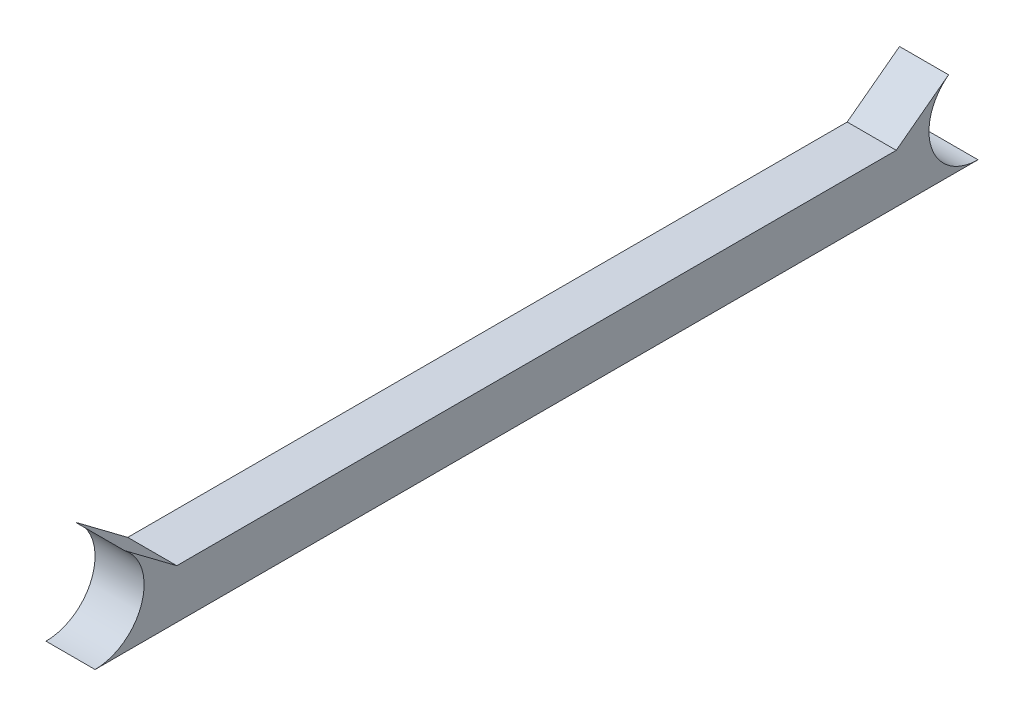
ISO-10303-21;
HEADER;
FILE_DESCRIPTION(('STEP AP214'),'2;1');
FILE_NAME('part.step','',(''),(''),'','','');
FILE_SCHEMA(('AUTOMOTIVE_DESIGN { 1 0 10303 214 1 1 1 1 }'));
ENDSEC;
DATA;
#1=APPLICATION_CONTEXT('core data for automotive mechanical design processes');
#2=APPLICATION_PROTOCOL_DEFINITION('international standard','automotive_design',2000,#1);
#3=PRODUCT_CONTEXT('',#1,'mechanical');
#4=PRODUCT('Part','Part','',(#3));
#5=PRODUCT_RELATED_PRODUCT_CATEGORY('part','',(#4));
#6=PRODUCT_DEFINITION_FORMATION('','',#4);
#7=PRODUCT_DEFINITION_CONTEXT('part definition',#1,'design');
#8=PRODUCT_DEFINITION('design','',#6,#7);
#9=PRODUCT_DEFINITION_SHAPE('','',#8);
#10=(LENGTH_UNIT() NAMED_UNIT(*) SI_UNIT(.MILLI.,.METRE.));
#11=(NAMED_UNIT(*) PLANE_ANGLE_UNIT() SI_UNIT($,.RADIAN.));
#12=(NAMED_UNIT(*) SI_UNIT($,.STERADIAN.) SOLID_ANGLE_UNIT());
#13=UNCERTAINTY_MEASURE_WITH_UNIT(LENGTH_MEASURE(1.E-05),#10,'distance_accuracy_value','');
#14=(GEOMETRIC_REPRESENTATION_CONTEXT(3) GLOBAL_UNCERTAINTY_ASSIGNED_CONTEXT((#13)) GLOBAL_UNIT_ASSIGNED_CONTEXT((#10,
#11,#12)) REPRESENTATION_CONTEXT('',''));
#15=CARTESIAN_POINT('',(0.,0.,0.));
#16=DIRECTION('',(0.,0.,1.));
#17=DIRECTION('',(1.,0.,0.));
#18=AXIS2_PLACEMENT_3D('',#15,#16,#17);
#19=CARTESIAN_POINT('',(22.5,0.,-810.));
#20=DIRECTION('',(-1.,0.,0.));
#21=DIRECTION('',(0.,0.,1.));
#22=AXIS2_PLACEMENT_3D('',#19,#20,#21);
#23=CYLINDRICAL_SURFACE('',#22,45.);
#24=CARTESIAN_POINT('',(-22.5,0.,-810.));
#25=DIRECTION('',(-1.,0.,0.));
#26=DIRECTION('',(0.,0.,1.));
#27=AXIS2_PLACEMENT_3D('',#24,#25,#26);
#28=CIRCLE('',#27,45.);
#29=CARTESIAN_POINT('',(-22.5,-45.,-810.));
#30=VERTEX_POINT('',#29);
#31=CARTESIAN_POINT('',(-22.5,36.,-783.));
#32=VERTEX_POINT('',#31);
#33=EDGE_CURVE('E116',#30,#32,#28,.T.);
#34=ORIENTED_EDGE('',*,*,#33,.T.);
#35=DIRECTION('',(-1.,0.,0.));
#36=VECTOR('',#35,1.);
#37=CARTESIAN_POINT('',(22.5,36.,-783.));
#38=LINE('',#37,#36);
#39=CARTESIAN_POINT('',(22.5,36.,-783.));
#40=VERTEX_POINT('',#39);
#41=EDGE_CURVE('E11',#40,#32,#38,.T.);
#42=ORIENTED_EDGE('',*,*,#41,.F.);
#43=CARTESIAN_POINT('',(22.5,0.,-810.));
#44=DIRECTION('',(-1.,0.,0.));
#45=DIRECTION('',(0.,0.,1.));
#46=AXIS2_PLACEMENT_3D('',#43,#44,#45);
#47=CIRCLE('',#46,45.);
#48=CARTESIAN_POINT('',(22.5,-45.,-810.));
#49=VERTEX_POINT('',#48);
#50=EDGE_CURVE('E126',#49,#40,#47,.T.);
#51=ORIENTED_EDGE('',*,*,#50,.F.);
#52=DIRECTION('',(-1.,0.,0.));
#53=VECTOR('',#52,1.);
#54=CARTESIAN_POINT('',(22.5,-45.,-810.));
#55=LINE('',#54,#53);
#56=EDGE_CURVE('E112',#49,#30,#55,.T.);
#57=ORIENTED_EDGE('',*,*,#56,.T.);
#58=EDGE_LOOP('',(#34,#42,#51,#57));
#59=FACE_BOUND('',#58,.T.);
#60=ADVANCED_FACE('F32',(#59),#23,.F.);
#61=CARTESIAN_POINT('',(22.5,36.,-783.));
#62=DIRECTION('',(0.,-0.8,-0.6));
#63=DIRECTION('',(0.,0.6,-0.8));
#64=AXIS2_PLACEMENT_3D('',#61,#62,#63);
#65=PLANE('',#64);
#66=DIRECTION('',(0.,-0.6,0.8));
#67=VECTOR('',#66,1.);
#68=CARTESIAN_POINT('',(-22.5,36.,-783.));
#69=LINE('',#68,#67);
#70=CARTESIAN_POINT('',(-22.5,0.,-735.));
#71=VERTEX_POINT('',#70);
#72=EDGE_CURVE('E119',#32,#71,#69,.T.);
#73=ORIENTED_EDGE('',*,*,#72,.T.);
#74=DIRECTION('',(-1.,0.,0.));
#75=VECTOR('',#74,1.);
#76=CARTESIAN_POINT('',(22.5,0.,-735.));
#77=LINE('',#76,#75);
#78=CARTESIAN_POINT('',(22.5,0.,-735.));
#79=VERTEX_POINT('',#78);
#80=EDGE_CURVE('E40',#79,#71,#77,.T.);
#81=ORIENTED_EDGE('',*,*,#80,.F.);
#82=DIRECTION('',(0.,-0.6,0.8));
#83=VECTOR('',#82,1.);
#84=CARTESIAN_POINT('',(22.5,36.,-783.));
#85=LINE('',#84,#83);
#86=EDGE_CURVE('E85',#40,#79,#85,.T.);
#87=ORIENTED_EDGE('',*,*,#86,.F.);
#88=ORIENTED_EDGE('',*,*,#41,.T.);
#89=EDGE_LOOP('',(#73,#81,#87,#88));
#90=FACE_BOUND('',#89,.T.);
#91=ADVANCED_FACE('F150',(#90),#65,.F.);
#92=CARTESIAN_POINT('',(22.5,0.,-75.));
#93=DIRECTION('',(0.,-1.,0.));
#94=DIRECTION('',(0.,0.,-1.));
#95=AXIS2_PLACEMENT_3D('',#92,#93,#94);
#96=PLANE('',#95);
#97=DIRECTION('',(0.,0.,1.));
#98=VECTOR('',#97,1.);
#99=CARTESIAN_POINT('',(-22.5,0.,-75.));
#100=LINE('',#99,#98);
#101=CARTESIAN_POINT('',(-22.5,0.,-75.));
#102=VERTEX_POINT('',#101);
#103=EDGE_CURVE('E121',#71,#102,#100,.T.);
#104=ORIENTED_EDGE('',*,*,#103,.T.);
#105=DIRECTION('',(-1.,0.,0.));
#106=VECTOR('',#105,1.);
#107=CARTESIAN_POINT('',(22.5,0.,-75.));
#108=LINE('',#107,#106);
#109=CARTESIAN_POINT('',(22.5,0.,-75.));
#110=VERTEX_POINT('',#109);
#111=EDGE_CURVE('E107',#110,#102,#108,.T.);
#112=ORIENTED_EDGE('',*,*,#111,.F.);
#113=DIRECTION('',(0.,0.,1.));
#114=VECTOR('',#113,1.);
#115=CARTESIAN_POINT('',(22.5,0.,-75.));
#116=LINE('',#115,#114);
#117=EDGE_CURVE('E98',#79,#110,#116,.T.);
#118=ORIENTED_EDGE('',*,*,#117,.F.);
#119=ORIENTED_EDGE('',*,*,#80,.T.);
#120=EDGE_LOOP('',(#104,#112,#118,#119));
#121=FACE_BOUND('',#120,.T.);
#122=ADVANCED_FACE('F132',(#121),#96,.F.);
#123=CARTESIAN_POINT('',(22.5,36.,-27.));
#124=DIRECTION('',(0.,-0.8,0.6));
#125=DIRECTION('',(0.,-0.6,-0.8));
#126=AXIS2_PLACEMENT_3D('',#123,#124,#125);
#127=PLANE('',#126);
#128=DIRECTION('',(0.,0.6,0.8));
#129=VECTOR('',#128,1.);
#130=CARTESIAN_POINT('',(-22.5,36.,-27.));
#131=LINE('',#130,#129);
#132=CARTESIAN_POINT('',(-22.5,36.,-27.));
#133=VERTEX_POINT('',#132);
#134=EDGE_CURVE('E106',#102,#133,#131,.T.);
#135=ORIENTED_EDGE('',*,*,#134,.T.);
#136=DIRECTION('',(-1.,0.,0.));
#137=VECTOR('',#136,1.);
#138=CARTESIAN_POINT('',(22.5,36.,-27.));
#139=LINE('',#138,#137);
#140=CARTESIAN_POINT('',(22.5,36.,-27.));
#141=VERTEX_POINT('',#140);
#142=EDGE_CURVE('E103',#141,#133,#139,.T.);
#143=ORIENTED_EDGE('',*,*,#142,.F.);
#144=DIRECTION('',(0.,0.6,0.8));
#145=VECTOR('',#144,1.);
#146=CARTESIAN_POINT('',(22.5,36.,-27.));
#147=LINE('',#146,#145);
#148=EDGE_CURVE('E92',#110,#141,#147,.T.);
#149=ORIENTED_EDGE('',*,*,#148,.F.);
#150=ORIENTED_EDGE('',*,*,#111,.T.);
#151=EDGE_LOOP('',(#135,#143,#149,#150));
#152=FACE_BOUND('',#151,.T.);
#153=ADVANCED_FACE('F104',(#152),#127,.F.);
#154=CARTESIAN_POINT('',(22.5,0.,0.));
#155=DIRECTION('',(-1.,0.,0.));
#156=DIRECTION('',(0.,0.,1.));
#157=AXIS2_PLACEMENT_3D('',#154,#155,#156);
#158=CYLINDRICAL_SURFACE('',#157,45.);
#159=CARTESIAN_POINT('',(-22.5,0.,0.));
#160=DIRECTION('',(-1.,0.,0.));
#161=DIRECTION('',(0.,0.,-1.));
#162=AXIS2_PLACEMENT_3D('',#159,#160,#161);
#163=CIRCLE('',#162,45.);
#164=CARTESIAN_POINT('',(-22.5,-45.,0.));
#165=VERTEX_POINT('',#164);
#166=EDGE_CURVE('E71',#133,#165,#163,.T.);
#167=ORIENTED_EDGE('',*,*,#166,.T.);
#168=DIRECTION('',(-1.,0.,0.));
#169=VECTOR('',#168,1.);
#170=CARTESIAN_POINT('',(22.5,-45.,0.));
#171=LINE('',#170,#169);
#172=CARTESIAN_POINT('',(22.5,-45.,0.));
#173=VERTEX_POINT('',#172);
#174=EDGE_CURVE('E108',#173,#165,#171,.T.);
#175=ORIENTED_EDGE('',*,*,#174,.F.);
#176=CARTESIAN_POINT('',(22.5,0.,0.));
#177=DIRECTION('',(-1.,0.,0.));
#178=DIRECTION('',(0.,0.,-1.));
#179=AXIS2_PLACEMENT_3D('',#176,#177,#178);
#180=CIRCLE('',#179,45.);
#181=EDGE_CURVE('E96',#141,#173,#180,.T.);
#182=ORIENTED_EDGE('',*,*,#181,.F.);
#183=ORIENTED_EDGE('',*,*,#142,.T.);
#184=EDGE_LOOP('',(#167,#175,#182,#183));
#185=FACE_BOUND('',#184,.T.);
#186=ADVANCED_FACE('F110',(#185),#158,.F.);
#187=CARTESIAN_POINT('',(22.5,-45.,0.));
#188=DIRECTION('',(0.,1.,0.));
#189=DIRECTION('',(0.,0.,1.));
#190=AXIS2_PLACEMENT_3D('',#187,#188,#189);
#191=PLANE('',#190);
#192=DIRECTION('',(0.,0.,-1.));
#193=VECTOR('',#192,1.);
#194=CARTESIAN_POINT('',(-22.5,-45.,0.));
#195=LINE('',#194,#193);
#196=EDGE_CURVE('E77',#165,#30,#195,.T.);
#197=ORIENTED_EDGE('',*,*,#196,.T.);
#198=ORIENTED_EDGE('',*,*,#56,.F.);
#199=DIRECTION('',(0.,0.,-1.));
#200=VECTOR('',#199,1.);
#201=CARTESIAN_POINT('',(22.5,-45.,0.));
#202=LINE('',#201,#200);
#203=EDGE_CURVE('E48',#173,#49,#202,.T.);
#204=ORIENTED_EDGE('',*,*,#203,.F.);
#205=ORIENTED_EDGE('',*,*,#174,.T.);
#206=EDGE_LOOP('',(#197,#198,#204,#205));
#207=FACE_BOUND('',#206,.T.);
#208=ADVANCED_FACE('F139',(#207),#191,.F.);
#209=CARTESIAN_POINT('',(22.5,0.,-810.));
#210=DIRECTION('',(-1.,0.,0.));
#211=DIRECTION('',(0.,0.,1.));
#212=AXIS2_PLACEMENT_3D('',#209,#210,#211);
#213=PLANE('',#212);
#214=ORIENTED_EDGE('',*,*,#50,.T.);
#215=ORIENTED_EDGE('',*,*,#86,.T.);
#216=ORIENTED_EDGE('',*,*,#117,.T.);
#217=ORIENTED_EDGE('',*,*,#148,.T.);
#218=ORIENTED_EDGE('',*,*,#181,.T.);
#219=ORIENTED_EDGE('',*,*,#203,.T.);
#220=EDGE_LOOP('',(#214,#215,#216,#217,#218,#219));
#221=FACE_BOUND('',#220,.T.);
#222=ADVANCED_FACE('F94',(#221),#213,.F.);
#223=CARTESIAN_POINT('',(-22.5,0.,-810.));
#224=DIRECTION('',(-1.,0.,0.));
#225=DIRECTION('',(0.,0.,1.));
#226=AXIS2_PLACEMENT_3D('',#223,#224,#225);
#227=PLANE('',#226);
#228=ORIENTED_EDGE('',*,*,#33,.F.);
#229=ORIENTED_EDGE('',*,*,#196,.F.);
#230=ORIENTED_EDGE('',*,*,#166,.F.);
#231=ORIENTED_EDGE('',*,*,#134,.F.);
#232=ORIENTED_EDGE('',*,*,#103,.F.);
#233=ORIENTED_EDGE('',*,*,#72,.F.);
#234=EDGE_LOOP('',(#228,#229,#230,#231,#232,#233));
#235=FACE_BOUND('',#234,.T.);
#236=ADVANCED_FACE('F135',(#235),#227,.T.);
#237=CLOSED_SHELL('',(#60,#91,#122,#153,#186,#208,#222,#236));
#238=MANIFOLD_SOLID_BREP('B2',#237);
#239=ADVANCED_BREP_SHAPE_REPRESENTATION('',(#18,#238),#14);
#240=SHAPE_DEFINITION_REPRESENTATION(#9,#239);
ENDSEC;
END-ISO-10303-21;
